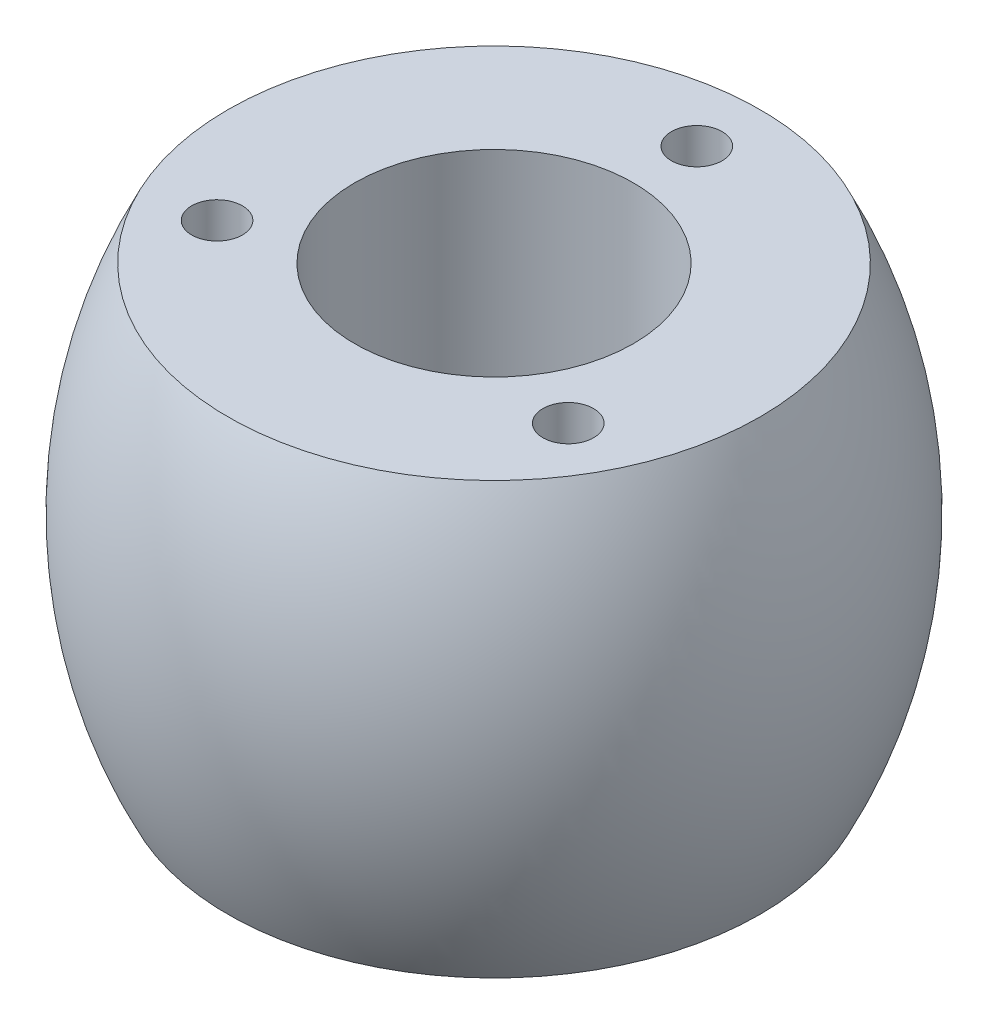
ISO-10303-21;
HEADER;
FILE_DESCRIPTION(('STEP AP214'),'2;1');
FILE_NAME('part.step','',(''),(''),'','','');
FILE_SCHEMA(('AUTOMOTIVE_DESIGN { 1 0 10303 214 1 1 1 1 }'));
ENDSEC;
DATA;
#1=APPLICATION_CONTEXT('core data for automotive mechanical design processes');
#2=APPLICATION_PROTOCOL_DEFINITION('international standard','automotive_design',2000,#1);
#3=PRODUCT_CONTEXT('',#1,'mechanical');
#4=PRODUCT('Part','Part','',(#3));
#5=PRODUCT_RELATED_PRODUCT_CATEGORY('part','',(#4));
#6=PRODUCT_DEFINITION_FORMATION('','',#4);
#7=PRODUCT_DEFINITION_CONTEXT('part definition',#1,'design');
#8=PRODUCT_DEFINITION('design','',#6,#7);
#9=PRODUCT_DEFINITION_SHAPE('','',#8);
#10=(LENGTH_UNIT() NAMED_UNIT(*) SI_UNIT(.MILLI.,.METRE.));
#11=(NAMED_UNIT(*) PLANE_ANGLE_UNIT() SI_UNIT($,.RADIAN.));
#12=(NAMED_UNIT(*) SI_UNIT($,.STERADIAN.) SOLID_ANGLE_UNIT());
#13=UNCERTAINTY_MEASURE_WITH_UNIT(LENGTH_MEASURE(1.E-05),#10,'distance_accuracy_value','');
#14=(GEOMETRIC_REPRESENTATION_CONTEXT(3) GLOBAL_UNCERTAINTY_ASSIGNED_CONTEXT((#13)) GLOBAL_UNIT_ASSIGNED_CONTEXT((#10,
#11,#12)) REPRESENTATION_CONTEXT('',''));
#15=CARTESIAN_POINT('',(0.,0.,0.));
#16=DIRECTION('',(0.,0.,1.));
#17=DIRECTION('',(1.,0.,0.));
#18=AXIS2_PLACEMENT_3D('',#15,#16,#17);
#19=CARTESIAN_POINT('',(0.,0.,0.));
#20=DIRECTION('',(0.,1.,0.));
#21=DIRECTION('',(-1.,0.,0.));
#22=AXIS2_PLACEMENT_3D('',#19,#20,#21);
#23=PLANE('',#22);
#24=CARTESIAN_POINT('',(13.8564064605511,0.,7.99999999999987));
#25=DIRECTION('',(0.,-1.,0.));
#26=DIRECTION('',(-0.499999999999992,0.,0.866025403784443));
#27=AXIS2_PLACEMENT_3D('',#24,#25,#26);
#28=CIRCLE('',#27,2.);
#29=CARTESIAN_POINT('',(12.8564064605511,0.,9.73205080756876));
#30=VERTEX_POINT('',#29);
#31=EDGE_CURVE('E79',#30,#30,#28,.T.);
#32=ORIENTED_EDGE('',*,*,#31,.F.);
#33=EDGE_LOOP('',(#32));
#34=FACE_BOUND('',#33,.T.);
#35=CARTESIAN_POINT('',(-13.856406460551,0.,8.00000000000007));
#36=DIRECTION('',(0.,-1.,0.));
#37=DIRECTION('',(-0.500000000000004,0.,-0.866025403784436));
#38=AXIS2_PLACEMENT_3D('',#35,#36,#37);
#39=CIRCLE('',#38,2.);
#40=CARTESIAN_POINT('',(-14.856406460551,0.,6.26794919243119));
#41=VERTEX_POINT('',#40);
#42=EDGE_CURVE('E73',#41,#41,#39,.T.);
#43=ORIENTED_EDGE('',*,*,#42,.F.);
#44=EDGE_LOOP('',(#43));
#45=FACE_BOUND('',#44,.T.);
#46=CARTESIAN_POINT('',(0.,0.,-16.));
#47=DIRECTION('',(0.,-1.,0.));
#48=DIRECTION('',(1.,0.,0.));
#49=AXIS2_PLACEMENT_3D('',#46,#47,#48);
#50=CIRCLE('',#49,2.);
#51=CARTESIAN_POINT('',(2.,0.,-16.));
#52=VERTEX_POINT('',#51);
#53=EDGE_CURVE('E67',#52,#52,#50,.T.);
#54=ORIENTED_EDGE('',*,*,#53,.F.);
#55=EDGE_LOOP('',(#54));
#56=FACE_BOUND('',#55,.T.);
#57=CARTESIAN_POINT('',(0.,0.,0.));
#58=DIRECTION('',(0.,1.,0.));
#59=DIRECTION('',(-1.,0.,0.));
#60=AXIS2_PLACEMENT_3D('',#57,#58,#59);
#61=CIRCLE('',#60,11.);
#62=CARTESIAN_POINT('',(-11.,0.,0.));
#63=VERTEX_POINT('',#62);
#64=EDGE_CURVE('E39',#63,#63,#61,.T.);
#65=ORIENTED_EDGE('',*,*,#64,.T.);
#66=EDGE_LOOP('',(#65));
#67=FACE_BOUND('',#66,.T.);
#68=CARTESIAN_POINT('',(0.,0.,0.));
#69=DIRECTION('',(0.,1.,0.));
#70=DIRECTION('',(-1.,0.,0.));
#71=AXIS2_PLACEMENT_3D('',#68,#69,#70);
#72=CIRCLE('',#71,21.);
#73=CARTESIAN_POINT('',(-21.,0.,0.));
#74=VERTEX_POINT('',#73);
#75=EDGE_CURVE('E10',#74,#74,#72,.T.);
#76=ORIENTED_EDGE('',*,*,#75,.F.);
#77=EDGE_LOOP('',(#76));
#78=FACE_BOUND('',#77,.T.);
#79=ADVANCED_FACE('F29',(#34,#45,#56,#67,#78),#23,.F.);
#80=CARTESIAN_POINT('',(0.,17.,0.));
#81=DIRECTION('',(0.,1.,0.));
#82=DIRECTION('',(-1.,0.,0.));
#83=AXIS2_PLACEMENT_3D('',#80,#81,#82);
#84=DEGENERATE_TOROIDAL_SURFACE('',#83,13.125,38.125,.F.);
#85=CARTESIAN_POINT('',(0.,34.,0.));
#86=DIRECTION('',(0.,1.,0.));
#87=DIRECTION('',(-1.,0.,0.));
#88=AXIS2_PLACEMENT_3D('',#85,#86,#87);
#89=CIRCLE('',#88,21.);
#90=CARTESIAN_POINT('',(-21.,34.,0.));
#91=VERTEX_POINT('',#90);
#92=EDGE_CURVE('E35',#91,#91,#89,.T.);
#93=ORIENTED_EDGE('',*,*,#92,.F.);
#94=EDGE_LOOP('',(#93));
#95=FACE_BOUND('',#94,.T.);
#96=ORIENTED_EDGE('',*,*,#75,.T.);
#97=EDGE_LOOP('',(#96));
#98=FACE_BOUND('',#97,.T.);
#99=ADVANCED_FACE('F96',(#95,#98),#84,.F.);
#100=CARTESIAN_POINT('',(0.,34.,0.));
#101=DIRECTION('',(0.,-1.,0.));
#102=DIRECTION('',(1.,0.,0.));
#103=AXIS2_PLACEMENT_3D('',#100,#101,#102);
#104=PLANE('',#103);
#105=CARTESIAN_POINT('',(13.8564064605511,34.,7.99999999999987));
#106=DIRECTION('',(0.,1.,0.));
#107=DIRECTION('',(0.499999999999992,0.,-0.866025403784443));
#108=AXIS2_PLACEMENT_3D('',#105,#106,#107);
#109=CIRCLE('',#108,2.);
#110=CARTESIAN_POINT('',(14.8564064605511,34.,6.26794919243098));
#111=VERTEX_POINT('',#110);
#112=EDGE_CURVE('E61',#111,#111,#109,.T.);
#113=ORIENTED_EDGE('',*,*,#112,.F.);
#114=EDGE_LOOP('',(#113));
#115=FACE_BOUND('',#114,.T.);
#116=CARTESIAN_POINT('',(-13.856406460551,34.,8.00000000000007));
#117=DIRECTION('',(0.,1.,0.));
#118=DIRECTION('',(0.500000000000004,0.,0.866025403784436));
#119=AXIS2_PLACEMENT_3D('',#116,#117,#118);
#120=CIRCLE('',#119,2.);
#121=CARTESIAN_POINT('',(-12.856406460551,34.,9.73205080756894));
#122=VERTEX_POINT('',#121);
#123=EDGE_CURVE('E55',#122,#122,#120,.T.);
#124=ORIENTED_EDGE('',*,*,#123,.F.);
#125=EDGE_LOOP('',(#124));
#126=FACE_BOUND('',#125,.T.);
#127=CARTESIAN_POINT('',(0.,34.,-16.));
#128=DIRECTION('',(0.,1.,0.));
#129=DIRECTION('',(-1.,0.,0.));
#130=AXIS2_PLACEMENT_3D('',#127,#128,#129);
#131=CIRCLE('',#130,2.);
#132=CARTESIAN_POINT('',(-2.,34.,-16.));
#133=VERTEX_POINT('',#132);
#134=EDGE_CURVE('E49',#133,#133,#131,.T.);
#135=ORIENTED_EDGE('',*,*,#134,.F.);
#136=EDGE_LOOP('',(#135));
#137=FACE_BOUND('',#136,.T.);
#138=CARTESIAN_POINT('',(0.,34.,0.));
#139=DIRECTION('',(0.,1.,0.));
#140=DIRECTION('',(-1.,0.,0.));
#141=AXIS2_PLACEMENT_3D('',#138,#139,#140);
#142=CIRCLE('',#141,11.);
#143=CARTESIAN_POINT('',(-11.,34.,0.));
#144=VERTEX_POINT('',#143);
#145=EDGE_CURVE('E43',#144,#144,#142,.T.);
#146=ORIENTED_EDGE('',*,*,#145,.F.);
#147=EDGE_LOOP('',(#146));
#148=FACE_BOUND('',#147,.T.);
#149=ORIENTED_EDGE('',*,*,#92,.T.);
#150=EDGE_LOOP('',(#149));
#151=FACE_BOUND('',#150,.T.);
#152=ADVANCED_FACE('F108',(#115,#126,#137,#148,#151),#104,.F.);
#153=CARTESIAN_POINT('',(0.,0.,0.));
#154=DIRECTION('',(0.,1.,0.));
#155=DIRECTION('',(-1.,0.,0.));
#156=AXIS2_PLACEMENT_3D('',#153,#154,#155);
#157=CYLINDRICAL_SURFACE('',#156,11.);
#158=ORIENTED_EDGE('',*,*,#64,.F.);
#159=EDGE_LOOP('',(#158));
#160=FACE_BOUND('',#159,.T.);
#161=ORIENTED_EDGE('',*,*,#145,.T.);
#162=EDGE_LOOP('',(#161));
#163=FACE_BOUND('',#162,.T.);
#164=ADVANCED_FACE('F104',(#160,#163),#157,.F.);
#165=CARTESIAN_POINT('',(0.,26.,-16.));
#166=DIRECTION('',(0.,1.,0.));
#167=DIRECTION('',(-1.,0.,0.));
#168=AXIS2_PLACEMENT_3D('',#165,#166,#167);
#169=CYLINDRICAL_SURFACE('',#168,2.);
#170=CARTESIAN_POINT('',(0.,26.,-16.));
#171=DIRECTION('',(0.,1.,0.));
#172=DIRECTION('',(-1.,0.,0.));
#173=AXIS2_PLACEMENT_3D('',#170,#171,#172);
#174=CIRCLE('',#173,2.);
#175=CARTESIAN_POINT('',(-2.,26.,-16.));
#176=VERTEX_POINT('',#175);
#177=EDGE_CURVE('E47',#176,#176,#174,.T.);
#178=ORIENTED_EDGE('',*,*,#177,.F.);
#179=EDGE_LOOP('',(#178));
#180=FACE_BOUND('',#179,.T.);
#181=ORIENTED_EDGE('',*,*,#134,.T.);
#182=EDGE_LOOP('',(#181));
#183=FACE_BOUND('',#182,.T.);
#184=ADVANCED_FACE('F107',(#180,#183),#169,.F.);
#185=CARTESIAN_POINT('',(0.,26.,-16.));
#186=DIRECTION('',(0.,1.,0.));
#187=DIRECTION('',(-1.,0.,0.));
#188=AXIS2_PLACEMENT_3D('',#185,#186,#187);
#189=PLANE('',#188);
#190=ORIENTED_EDGE('',*,*,#177,.T.);
#191=EDGE_LOOP('',(#190));
#192=FACE_BOUND('',#191,.T.);
#193=ADVANCED_FACE('F124',(#192),#189,.T.);
#194=CARTESIAN_POINT('',(-13.856406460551,26.,8.00000000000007));
#195=DIRECTION('',(0.,1.,0.));
#196=DIRECTION('',(-1.,0.,0.));
#197=AXIS2_PLACEMENT_3D('',#194,#195,#196);
#198=CYLINDRICAL_SURFACE('',#197,2.);
#199=CARTESIAN_POINT('',(-13.856406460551,26.,8.00000000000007));
#200=DIRECTION('',(0.,1.,0.));
#201=DIRECTION('',(0.500000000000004,0.,0.866025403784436));
#202=AXIS2_PLACEMENT_3D('',#199,#200,#201);
#203=CIRCLE('',#202,2.);
#204=CARTESIAN_POINT('',(-12.856406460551,26.,9.73205080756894));
#205=VERTEX_POINT('',#204);
#206=EDGE_CURVE('E52',#205,#205,#203,.T.);
#207=ORIENTED_EDGE('',*,*,#206,.F.);
#208=EDGE_LOOP('',(#207));
#209=FACE_BOUND('',#208,.T.);
#210=ORIENTED_EDGE('',*,*,#123,.T.);
#211=EDGE_LOOP('',(#210));
#212=FACE_BOUND('',#211,.T.);
#213=ADVANCED_FACE('F128',(#209,#212),#198,.F.);
#214=CARTESIAN_POINT('',(-13.856406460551,26.,8.00000000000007));
#215=DIRECTION('',(0.,1.,0.));
#216=DIRECTION('',(0.500000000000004,0.,0.866025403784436));
#217=AXIS2_PLACEMENT_3D('',#214,#215,#216);
#218=PLANE('',#217);
#219=ORIENTED_EDGE('',*,*,#206,.T.);
#220=EDGE_LOOP('',(#219));
#221=FACE_BOUND('',#220,.T.);
#222=ADVANCED_FACE('F132',(#221),#218,.T.);
#223=CARTESIAN_POINT('',(13.8564064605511,26.,7.99999999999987));
#224=DIRECTION('',(0.,1.,0.));
#225=DIRECTION('',(-1.,0.,0.));
#226=AXIS2_PLACEMENT_3D('',#223,#224,#225);
#227=CYLINDRICAL_SURFACE('',#226,2.);
#228=CARTESIAN_POINT('',(13.8564064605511,26.,7.99999999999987));
#229=DIRECTION('',(0.,1.,0.));
#230=DIRECTION('',(0.499999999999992,0.,-0.866025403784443));
#231=AXIS2_PLACEMENT_3D('',#228,#229,#230);
#232=CIRCLE('',#231,2.);
#233=CARTESIAN_POINT('',(14.8564064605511,26.,6.26794919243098));
#234=VERTEX_POINT('',#233);
#235=EDGE_CURVE('E58',#234,#234,#232,.T.);
#236=ORIENTED_EDGE('',*,*,#235,.F.);
#237=EDGE_LOOP('',(#236));
#238=FACE_BOUND('',#237,.T.);
#239=ORIENTED_EDGE('',*,*,#112,.T.);
#240=EDGE_LOOP('',(#239));
#241=FACE_BOUND('',#240,.T.);
#242=ADVANCED_FACE('F136',(#238,#241),#227,.F.);
#243=CARTESIAN_POINT('',(13.8564064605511,26.,7.99999999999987));
#244=DIRECTION('',(0.,1.,0.));
#245=DIRECTION('',(0.499999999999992,0.,-0.866025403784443));
#246=AXIS2_PLACEMENT_3D('',#243,#244,#245);
#247=PLANE('',#246);
#248=ORIENTED_EDGE('',*,*,#235,.T.);
#249=EDGE_LOOP('',(#248));
#250=FACE_BOUND('',#249,.T.);
#251=ADVANCED_FACE('F140',(#250),#247,.T.);
#252=CARTESIAN_POINT('',(0.,8.,-16.));
#253=DIRECTION('',(0.,-1.,0.));
#254=DIRECTION('',(1.,0.,0.));
#255=AXIS2_PLACEMENT_3D('',#252,#253,#254);
#256=CYLINDRICAL_SURFACE('',#255,2.);
#257=CARTESIAN_POINT('',(0.,8.,-16.));
#258=DIRECTION('',(0.,-1.,0.));
#259=DIRECTION('',(1.,0.,0.));
#260=AXIS2_PLACEMENT_3D('',#257,#258,#259);
#261=CIRCLE('',#260,2.);
#262=CARTESIAN_POINT('',(2.,8.,-16.));
#263=VERTEX_POINT('',#262);
#264=EDGE_CURVE('E64',#263,#263,#261,.T.);
#265=ORIENTED_EDGE('',*,*,#264,.F.);
#266=EDGE_LOOP('',(#265));
#267=FACE_BOUND('',#266,.T.);
#268=ORIENTED_EDGE('',*,*,#53,.T.);
#269=EDGE_LOOP('',(#268));
#270=FACE_BOUND('',#269,.T.);
#271=ADVANCED_FACE('F144',(#267,#270),#256,.F.);
#272=CARTESIAN_POINT('',(0.,8.,-16.));
#273=DIRECTION('',(0.,-1.,0.));
#274=DIRECTION('',(1.,0.,0.));
#275=AXIS2_PLACEMENT_3D('',#272,#273,#274);
#276=PLANE('',#275);
#277=ORIENTED_EDGE('',*,*,#264,.T.);
#278=EDGE_LOOP('',(#277));
#279=FACE_BOUND('',#278,.T.);
#280=ADVANCED_FACE('F148',(#279),#276,.T.);
#281=CARTESIAN_POINT('',(-13.856406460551,8.,8.00000000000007));
#282=DIRECTION('',(0.,-1.,0.));
#283=DIRECTION('',(1.,0.,0.));
#284=AXIS2_PLACEMENT_3D('',#281,#282,#283);
#285=CYLINDRICAL_SURFACE('',#284,2.);
#286=CARTESIAN_POINT('',(-13.856406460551,8.,8.00000000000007));
#287=DIRECTION('',(0.,-1.,0.));
#288=DIRECTION('',(-0.500000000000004,0.,-0.866025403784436));
#289=AXIS2_PLACEMENT_3D('',#286,#287,#288);
#290=CIRCLE('',#289,2.);
#291=CARTESIAN_POINT('',(-14.856406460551,8.,6.26794919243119));
#292=VERTEX_POINT('',#291);
#293=EDGE_CURVE('E70',#292,#292,#290,.T.);
#294=ORIENTED_EDGE('',*,*,#293,.F.);
#295=EDGE_LOOP('',(#294));
#296=FACE_BOUND('',#295,.T.);
#297=ORIENTED_EDGE('',*,*,#42,.T.);
#298=EDGE_LOOP('',(#297));
#299=FACE_BOUND('',#298,.T.);
#300=ADVANCED_FACE('F152',(#296,#299),#285,.F.);
#301=CARTESIAN_POINT('',(-13.856406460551,8.,8.00000000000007));
#302=DIRECTION('',(0.,-1.,0.));
#303=DIRECTION('',(-0.500000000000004,0.,-0.866025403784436));
#304=AXIS2_PLACEMENT_3D('',#301,#302,#303);
#305=PLANE('',#304);
#306=ORIENTED_EDGE('',*,*,#293,.T.);
#307=EDGE_LOOP('',(#306));
#308=FACE_BOUND('',#307,.T.);
#309=ADVANCED_FACE('F90',(#308),#305,.T.);
#310=CARTESIAN_POINT('',(13.8564064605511,8.,7.99999999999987));
#311=DIRECTION('',(0.,-1.,0.));
#312=DIRECTION('',(1.,0.,0.));
#313=AXIS2_PLACEMENT_3D('',#310,#311,#312);
#314=CYLINDRICAL_SURFACE('',#313,2.);
#315=CARTESIAN_POINT('',(13.8564064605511,8.,7.99999999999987));
#316=DIRECTION('',(0.,-1.,0.));
#317=DIRECTION('',(-0.499999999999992,0.,0.866025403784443));
#318=AXIS2_PLACEMENT_3D('',#315,#316,#317);
#319=CIRCLE('',#318,2.);
#320=CARTESIAN_POINT('',(12.8564064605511,8.,9.73205080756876));
#321=VERTEX_POINT('',#320);
#322=EDGE_CURVE('E76',#321,#321,#319,.T.);
#323=ORIENTED_EDGE('',*,*,#322,.F.);
#324=EDGE_LOOP('',(#323));
#325=FACE_BOUND('',#324,.T.);
#326=ORIENTED_EDGE('',*,*,#31,.T.);
#327=EDGE_LOOP('',(#326));
#328=FACE_BOUND('',#327,.T.);
#329=ADVANCED_FACE('F87',(#325,#328),#314,.F.);
#330=CARTESIAN_POINT('',(13.8564064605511,8.,7.99999999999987));
#331=DIRECTION('',(0.,-1.,0.));
#332=DIRECTION('',(-0.499999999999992,0.,0.866025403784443));
#333=AXIS2_PLACEMENT_3D('',#330,#331,#332);
#334=PLANE('',#333);
#335=ORIENTED_EDGE('',*,*,#322,.T.);
#336=EDGE_LOOP('',(#335));
#337=FACE_BOUND('',#336,.T.);
#338=ADVANCED_FACE('F85',(#337),#334,.T.);
#339=CLOSED_SHELL('',(#79,#99,#152,#164,#184,#193,#213,#222,#242,#251,#271,#280,#300,#309,#329,#338));
#340=MANIFOLD_SOLID_BREP('B2',#339);
#341=ADVANCED_BREP_SHAPE_REPRESENTATION('',(#18,#340),#14);
#342=SHAPE_DEFINITION_REPRESENTATION(#9,#341);
ENDSEC;
END-ISO-10303-21;
